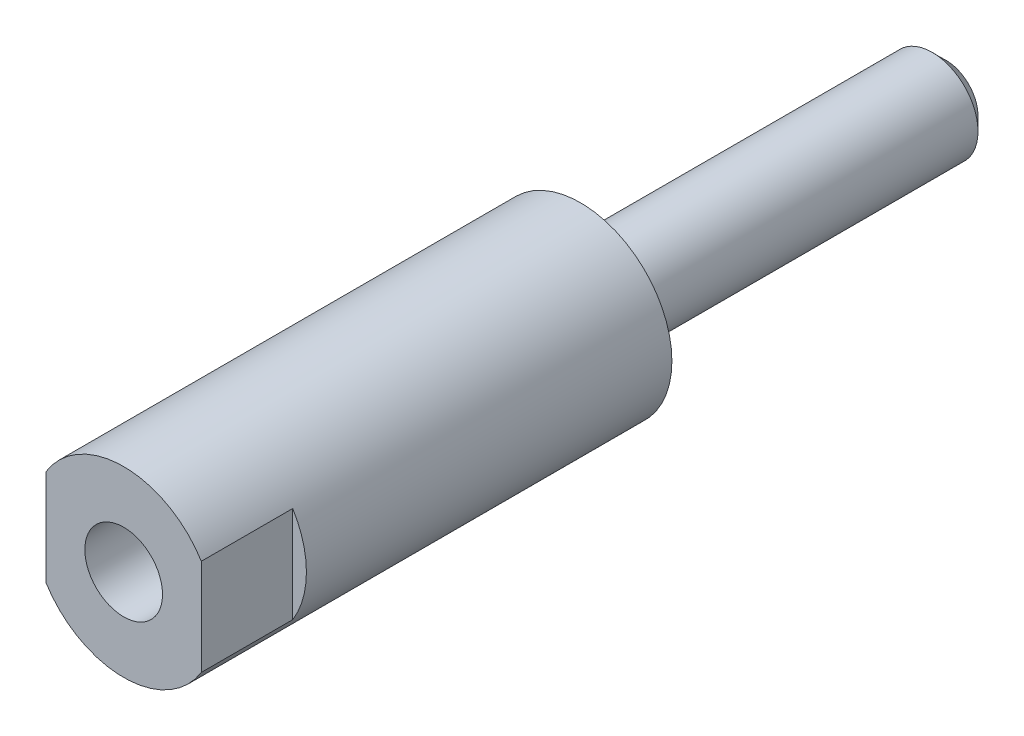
ISO-10303-21;
HEADER;
FILE_DESCRIPTION(('STEP AP214'),'2;1');
FILE_NAME('part.step','',(''),(''),'','','');
FILE_SCHEMA(('AUTOMOTIVE_DESIGN { 1 0 10303 214 1 1 1 1 }'));
ENDSEC;
DATA;
#1=APPLICATION_CONTEXT('core data for automotive mechanical design processes');
#2=APPLICATION_PROTOCOL_DEFINITION('international standard','automotive_design',2000,#1);
#3=PRODUCT_CONTEXT('',#1,'mechanical');
#4=PRODUCT('Part','Part','',(#3));
#5=PRODUCT_RELATED_PRODUCT_CATEGORY('part','',(#4));
#6=PRODUCT_DEFINITION_FORMATION('','',#4);
#7=PRODUCT_DEFINITION_CONTEXT('part definition',#1,'design');
#8=PRODUCT_DEFINITION('design','',#6,#7);
#9=PRODUCT_DEFINITION_SHAPE('','',#8);
#10=(LENGTH_UNIT() NAMED_UNIT(*) SI_UNIT(.MILLI.,.METRE.));
#11=(NAMED_UNIT(*) PLANE_ANGLE_UNIT() SI_UNIT($,.RADIAN.));
#12=(NAMED_UNIT(*) SI_UNIT($,.STERADIAN.) SOLID_ANGLE_UNIT());
#13=UNCERTAINTY_MEASURE_WITH_UNIT(LENGTH_MEASURE(1.E-05),#10,'distance_accuracy_value','');
#14=(GEOMETRIC_REPRESENTATION_CONTEXT(3) GLOBAL_UNCERTAINTY_ASSIGNED_CONTEXT((#13)) GLOBAL_UNIT_ASSIGNED_CONTEXT((#10,
#11,#12)) REPRESENTATION_CONTEXT('',''));
#15=CARTESIAN_POINT('',(0.,0.,0.));
#16=DIRECTION('',(0.,0.,1.));
#17=DIRECTION('',(1.,0.,0.));
#18=AXIS2_PLACEMENT_3D('',#15,#16,#17);
#19=CARTESIAN_POINT('',(0.,-9.43689570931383E-13,0.));
#20=DIRECTION('',(0.,0.,1.));
#21=DIRECTION('',(1.,0.,0.));
#22=AXIS2_PLACEMENT_3D('',#19,#20,#21);
#23=PLANE('',#22);
#24=CARTESIAN_POINT('',(0.,-9.43689570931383E-13,0.));
#25=DIRECTION('',(0.,0.,1.));
#26=DIRECTION('',(1.,0.,0.));
#27=AXIS2_PLACEMENT_3D('',#24,#25,#26);
#28=CIRCLE('',#27,10.);
#29=CARTESIAN_POINT('',(10.,-9.43689570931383E-13,0.));
#30=VERTEX_POINT('',#29);
#31=EDGE_CURVE('E155',#30,#30,#28,.T.);
#32=ORIENTED_EDGE('',*,*,#31,.F.);
#33=EDGE_LOOP('',(#32));
#34=FACE_BOUND('',#33,.T.);
#35=CARTESIAN_POINT('',(0.,-9.43689570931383E-13,0.));
#36=DIRECTION('',(0.,0.,1.));
#37=DIRECTION('',(1.,0.,0.));
#38=AXIS2_PLACEMENT_3D('',#35,#36,#37);
#39=CIRCLE('',#38,5.);
#40=CARTESIAN_POINT('',(5.,-9.43689570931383E-13,0.));
#41=VERTEX_POINT('',#40);
#42=EDGE_CURVE('E148',#41,#41,#39,.F.);
#43=ORIENTED_EDGE('',*,*,#42,.F.);
#44=EDGE_LOOP('',(#43));
#45=FACE_BOUND('',#44,.T.);
#46=ADVANCED_FACE('F81',(#34,#45),#23,.F.);
#47=CARTESIAN_POINT('',(0.,-9.43689570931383E-13,50.));
#48=DIRECTION('',(0.,0.,-1.));
#49=DIRECTION('',(-1.,0.,0.));
#50=AXIS2_PLACEMENT_3D('',#47,#48,#49);
#51=CYLINDRICAL_SURFACE('',#50,10.);
#52=CARTESIAN_POINT('',(0.,-9.43689570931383E-13,50.));
#53=DIRECTION('',(0.,0.,1.));
#54=DIRECTION('',(1.,0.,0.));
#55=AXIS2_PLACEMENT_3D('',#52,#53,#54);
#56=CIRCLE('',#55,10.);
#57=CARTESIAN_POINT('',(8.49999999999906,5.26782687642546,50.));
#58=VERTEX_POINT('',#57);
#59=CARTESIAN_POINT('',(-8.50000000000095,5.26782687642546,50.));
#60=VERTEX_POINT('',#59);
#61=EDGE_CURVE('E149',#58,#60,#56,.T.);
#62=ORIENTED_EDGE('',*,*,#61,.F.);
#63=DIRECTION('',(0.,0.,1.));
#64=VECTOR('',#63,1.);
#65=CARTESIAN_POINT('',(8.49999999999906,5.26782687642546,40.));
#66=LINE('',#65,#64);
#67=CARTESIAN_POINT('',(8.49999999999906,5.26782687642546,40.));
#68=VERTEX_POINT('',#67);
#69=EDGE_CURVE('E97',#68,#58,#66,.T.);
#70=ORIENTED_EDGE('',*,*,#69,.F.);
#71=CARTESIAN_POINT('',(0.,-9.43689570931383E-13,40.));
#72=DIRECTION('',(0.,0.,1.));
#73=DIRECTION('',(1.,0.,0.));
#74=AXIS2_PLACEMENT_3D('',#71,#72,#73);
#75=CIRCLE('',#74,10.);
#76=CARTESIAN_POINT('',(8.49999999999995,-5.26782687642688,40.));
#77=VERTEX_POINT('',#76);
#78=EDGE_CURVE('E135',#77,#68,#75,.T.);
#79=ORIENTED_EDGE('',*,*,#78,.F.);
#80=DIRECTION('',(0.,0.,1.));
#81=VECTOR('',#80,1.);
#82=CARTESIAN_POINT('',(8.49999999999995,-5.26782687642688,40.));
#83=LINE('',#82,#81);
#84=CARTESIAN_POINT('',(8.49999999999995,-5.26782687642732,50.));
#85=VERTEX_POINT('',#84);
#86=EDGE_CURVE('E129',#77,#85,#83,.T.);
#87=ORIENTED_EDGE('',*,*,#86,.T.);
#88=CARTESIAN_POINT('',(-8.50000000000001,-5.26782687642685,50.));
#89=VERTEX_POINT('',#88);
#90=EDGE_CURVE('E141',#89,#85,#56,.T.);
#91=ORIENTED_EDGE('',*,*,#90,.F.);
#92=DIRECTION('',(0.,0.,1.));
#93=VECTOR('',#92,1.);
#94=CARTESIAN_POINT('',(-8.50000000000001,-5.26782687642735,40.));
#95=LINE('',#94,#93);
#96=CARTESIAN_POINT('',(-8.50000000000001,-5.26782687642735,40.));
#97=VERTEX_POINT('',#96);
#98=EDGE_CURVE('E105',#97,#89,#95,.T.);
#99=ORIENTED_EDGE('',*,*,#98,.F.);
#100=CARTESIAN_POINT('',(0.,-9.43689570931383E-13,40.));
#101=DIRECTION('',(0.,0.,1.));
#102=DIRECTION('',(1.,0.,0.));
#103=AXIS2_PLACEMENT_3D('',#100,#101,#102);
#104=CIRCLE('',#103,10.);
#105=CARTESIAN_POINT('',(-8.50000000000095,5.26782687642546,40.));
#106=VERTEX_POINT('',#105);
#107=EDGE_CURVE('E299',#106,#97,#104,.T.);
#108=ORIENTED_EDGE('',*,*,#107,.F.);
#109=DIRECTION('',(0.,0.,1.));
#110=VECTOR('',#109,1.);
#111=CARTESIAN_POINT('',(-8.50000000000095,5.26782687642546,40.));
#112=LINE('',#111,#110);
#113=EDGE_CURVE('E304',#106,#60,#112,.T.);
#114=ORIENTED_EDGE('',*,*,#113,.T.);
#115=EDGE_LOOP('',(#62,#70,#79,#87,#91,#99,#108,#114));
#116=FACE_BOUND('',#115,.T.);
#117=ORIENTED_EDGE('',*,*,#31,.T.);
#118=EDGE_LOOP('',(#117));
#119=FACE_BOUND('',#118,.T.);
#120=ADVANCED_FACE('F83',(#116,#119),#51,.T.);
#121=CARTESIAN_POINT('',(0.,-9.43689570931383E-13,50.));
#122=DIRECTION('',(0.,0.,1.));
#123=DIRECTION('',(1.,0.,0.));
#124=AXIS2_PLACEMENT_3D('',#121,#122,#123);
#125=PLANE('',#124);
#126=DIRECTION('',(0.,-1.,0.));
#127=VECTOR('',#126,1.);
#128=CARTESIAN_POINT('',(8.49999999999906,5.26782687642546,50.));
#129=LINE('',#128,#127);
#130=EDGE_CURVE('E126',#58,#85,#129,.T.);
#131=ORIENTED_EDGE('',*,*,#130,.F.);
#132=ORIENTED_EDGE('',*,*,#61,.T.);
#133=DIRECTION('',(0.,1.,0.));
#134=VECTOR('',#133,1.);
#135=CARTESIAN_POINT('',(-8.50000000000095,5.26782687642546,50.));
#136=LINE('',#135,#134);
#137=EDGE_CURVE('E143',#89,#60,#136,.T.);
#138=ORIENTED_EDGE('',*,*,#137,.F.);
#139=ORIENTED_EDGE('',*,*,#90,.T.);
#140=EDGE_LOOP('',(#131,#132,#138,#139));
#141=FACE_BOUND('',#140,.T.);
#142=CARTESIAN_POINT('',(0.,-9.43689570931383E-13,50.));
#143=DIRECTION('',(0.,0.,1.));
#144=DIRECTION('',(1.,0.,0.));
#145=AXIS2_PLACEMENT_3D('',#142,#143,#144);
#146=CIRCLE('',#145,4.24999999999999);
#147=CARTESIAN_POINT('',(4.24999999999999,-9.43689570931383E-13,50.));
#148=VERTEX_POINT('',#147);
#149=EDGE_CURVE('E314',#148,#148,#146,.T.);
#150=ORIENTED_EDGE('',*,*,#149,.F.);
#151=EDGE_LOOP('',(#150));
#152=FACE_BOUND('',#151,.T.);
#153=ADVANCED_FACE('F145',(#141,#152),#125,.T.);
#154=CARTESIAN_POINT('',(0.,-9.43689570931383E-13,-40.));
#155=DIRECTION('',(0.,0.,1.));
#156=DIRECTION('',(1.,0.,0.));
#157=AXIS2_PLACEMENT_3D('',#154,#155,#156);
#158=CYLINDRICAL_SURFACE('',#157,5.);
#159=CARTESIAN_POINT('',(0.,-9.43689570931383E-13,-38.5));
#160=DIRECTION('',(0.,0.,-1.));
#161=DIRECTION('',(-1.,0.,0.));
#162=AXIS2_PLACEMENT_3D('',#159,#160,#161);
#163=CIRCLE('',#162,5.);
#164=CARTESIAN_POINT('',(-5.,-9.43689570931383E-13,-38.5));
#165=VERTEX_POINT('',#164);
#166=EDGE_CURVE('E12',#165,#165,#163,.F.);
#167=ORIENTED_EDGE('',*,*,#166,.T.);
#168=EDGE_LOOP('',(#167));
#169=FACE_BOUND('',#168,.T.);
#170=ORIENTED_EDGE('',*,*,#42,.T.);
#171=EDGE_LOOP('',(#170));
#172=FACE_BOUND('',#171,.T.);
#173=ADVANCED_FACE('F186',(#169,#172),#158,.T.);
#174=CARTESIAN_POINT('',(0.,-9.43689570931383E-13,-40.));
#175=DIRECTION('',(0.,0.,-1.));
#176=DIRECTION('',(-1.,0.,0.));
#177=AXIS2_PLACEMENT_3D('',#174,#175,#176);
#178=PLANE('',#177);
#179=CARTESIAN_POINT('',(0.,-9.43689570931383E-13,-40.));
#180=DIRECTION('',(0.,0.,-1.));
#181=DIRECTION('',(-1.,0.,0.));
#182=AXIS2_PLACEMENT_3D('',#179,#180,#181);
#183=CIRCLE('',#182,3.49999999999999);
#184=CARTESIAN_POINT('',(-3.49999999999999,-9.43689570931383E-13,-40.));
#185=VERTEX_POINT('',#184);
#186=EDGE_CURVE('E90',#185,#185,#183,.T.);
#187=ORIENTED_EDGE('',*,*,#186,.T.);
#188=EDGE_LOOP('',(#187));
#189=FACE_BOUND('',#188,.T.);
#190=ADVANCED_FACE('F164',(#189),#178,.T.);
#191=CARTESIAN_POINT('',(0.,-9.43689570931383E-13,50.));
#192=DIRECTION('',(0.,0.,1.));
#193=DIRECTION('',(1.,0.,0.));
#194=AXIS2_PLACEMENT_3D('',#191,#192,#193);
#195=CYLINDRICAL_SURFACE('',#194,4.24999999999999);
#196=CARTESIAN_POINT('',(0.,-9.43689570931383E-13,15.));
#197=DIRECTION('',(0.,0.,1.));
#198=DIRECTION('',(1.,0.,0.));
#199=AXIS2_PLACEMENT_3D('',#196,#197,#198);
#200=CIRCLE('',#199,4.24999999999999);
#201=CARTESIAN_POINT('',(4.24999999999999,-9.43689570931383E-13,15.));
#202=VERTEX_POINT('',#201);
#203=EDGE_CURVE('E309',#202,#202,#200,.T.);
#204=ORIENTED_EDGE('',*,*,#203,.F.);
#205=EDGE_LOOP('',(#204));
#206=FACE_BOUND('',#205,.T.);
#207=ORIENTED_EDGE('',*,*,#149,.T.);
#208=EDGE_LOOP('',(#207));
#209=FACE_BOUND('',#208,.T.);
#210=ADVANCED_FACE('F196',(#206,#209),#195,.F.);
#211=CARTESIAN_POINT('',(0.,-9.43689570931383E-13,15.));
#212=DIRECTION('',(0.,0.,1.));
#213=DIRECTION('',(1.,0.,0.));
#214=AXIS2_PLACEMENT_3D('',#211,#212,#213);
#215=CONICAL_SURFACE('',#214,4.24999999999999,1.02974425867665);
#216=CARTESIAN_POINT('',(0.,-9.43689570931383E-13,12.4463423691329));
#217=VERTEX_POINT('',#216);
#218=VERTEX_LOOP('',#217);
#219=FACE_BOUND('',#218,.T.);
#220=ORIENTED_EDGE('',*,*,#203,.T.);
#221=EDGE_LOOP('',(#220));
#222=FACE_BOUND('',#221,.T.);
#223=ADVANCED_FACE('F202',(#219,#222),#215,.F.);
#224=CARTESIAN_POINT('',(-8.50000000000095,5.26782687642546,40.));
#225=DIRECTION('',(1.,0.,0.));
#226=DIRECTION('',(0.,0.,-1.));
#227=AXIS2_PLACEMENT_3D('',#224,#225,#226);
#228=PLANE('',#227);
#229=ORIENTED_EDGE('',*,*,#137,.T.);
#230=ORIENTED_EDGE('',*,*,#113,.F.);
#231=DIRECTION('',(0.,1.,0.));
#232=VECTOR('',#231,1.);
#233=CARTESIAN_POINT('',(-8.50000000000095,5.26782687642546,40.));
#234=LINE('',#233,#232);
#235=EDGE_CURVE('E300',#97,#106,#234,.T.);
#236=ORIENTED_EDGE('',*,*,#235,.F.);
#237=ORIENTED_EDGE('',*,*,#98,.T.);
#238=EDGE_LOOP('',(#229,#230,#236,#237));
#239=FACE_BOUND('',#238,.T.);
#240=ADVANCED_FACE('F208',(#239),#228,.F.);
#241=CARTESIAN_POINT('',(0.,-9.43689570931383E-13,40.));
#242=DIRECTION('',(0.,0.,1.));
#243=DIRECTION('',(1.,0.,0.));
#244=AXIS2_PLACEMENT_3D('',#241,#242,#243);
#245=PLANE('',#244);
#246=ORIENTED_EDGE('',*,*,#107,.T.);
#247=ORIENTED_EDGE('',*,*,#235,.T.);
#248=EDGE_LOOP('',(#246,#247));
#249=FACE_BOUND('',#248,.T.);
#250=ADVANCED_FACE('F212',(#249),#245,.T.);
#251=CARTESIAN_POINT('',(8.49999999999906,5.26782687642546,40.));
#252=DIRECTION('',(-1.,0.,0.));
#253=DIRECTION('',(0.,0.,1.));
#254=AXIS2_PLACEMENT_3D('',#251,#252,#253);
#255=PLANE('',#254);
#256=ORIENTED_EDGE('',*,*,#130,.T.);
#257=ORIENTED_EDGE('',*,*,#86,.F.);
#258=DIRECTION('',(0.,-1.,0.));
#259=VECTOR('',#258,1.);
#260=CARTESIAN_POINT('',(8.49999999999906,5.26782687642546,40.));
#261=LINE('',#260,#259);
#262=EDGE_CURVE('E321',#68,#77,#261,.T.);
#263=ORIENTED_EDGE('',*,*,#262,.F.);
#264=ORIENTED_EDGE('',*,*,#69,.T.);
#265=EDGE_LOOP('',(#256,#257,#263,#264));
#266=FACE_BOUND('',#265,.T.);
#267=ADVANCED_FACE('F128',(#266),#255,.F.);
#268=CARTESIAN_POINT('',(0.,-9.43689570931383E-13,40.));
#269=DIRECTION('',(0.,0.,1.));
#270=DIRECTION('',(1.,0.,0.));
#271=AXIS2_PLACEMENT_3D('',#268,#269,#270);
#272=PLANE('',#271);
#273=ORIENTED_EDGE('',*,*,#78,.T.);
#274=ORIENTED_EDGE('',*,*,#262,.T.);
#275=EDGE_LOOP('',(#273,#274));
#276=FACE_BOUND('',#275,.T.);
#277=ADVANCED_FACE('F168',(#276),#272,.T.);
#278=CARTESIAN_POINT('',(0.,-9.43689570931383E-13,-40.));
#279=DIRECTION('',(0.,0.,1.));
#280=DIRECTION('',(1.,0.,0.));
#281=AXIS2_PLACEMENT_3D('',#278,#279,#280);
#282=CONICAL_SURFACE('',#281,3.49999999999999,0.785398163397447);
#283=ORIENTED_EDGE('',*,*,#166,.F.);
#284=EDGE_LOOP('',(#283));
#285=FACE_BOUND('',#284,.T.);
#286=ORIENTED_EDGE('',*,*,#186,.F.);
#287=EDGE_LOOP('',(#286));
#288=FACE_BOUND('',#287,.T.);
#289=ADVANCED_FACE('F166',(#285,#288),#282,.T.);
#290=CLOSED_SHELL('',(#46,#120,#153,#173,#190,#210,#223,#240,#250,#267,#277,#289));
#291=MANIFOLD_SOLID_BREP('B2',#290);
#292=ADVANCED_BREP_SHAPE_REPRESENTATION('',(#18,#291),#14);
#293=SHAPE_DEFINITION_REPRESENTATION(#9,#292);
ENDSEC;
END-ISO-10303-21;
